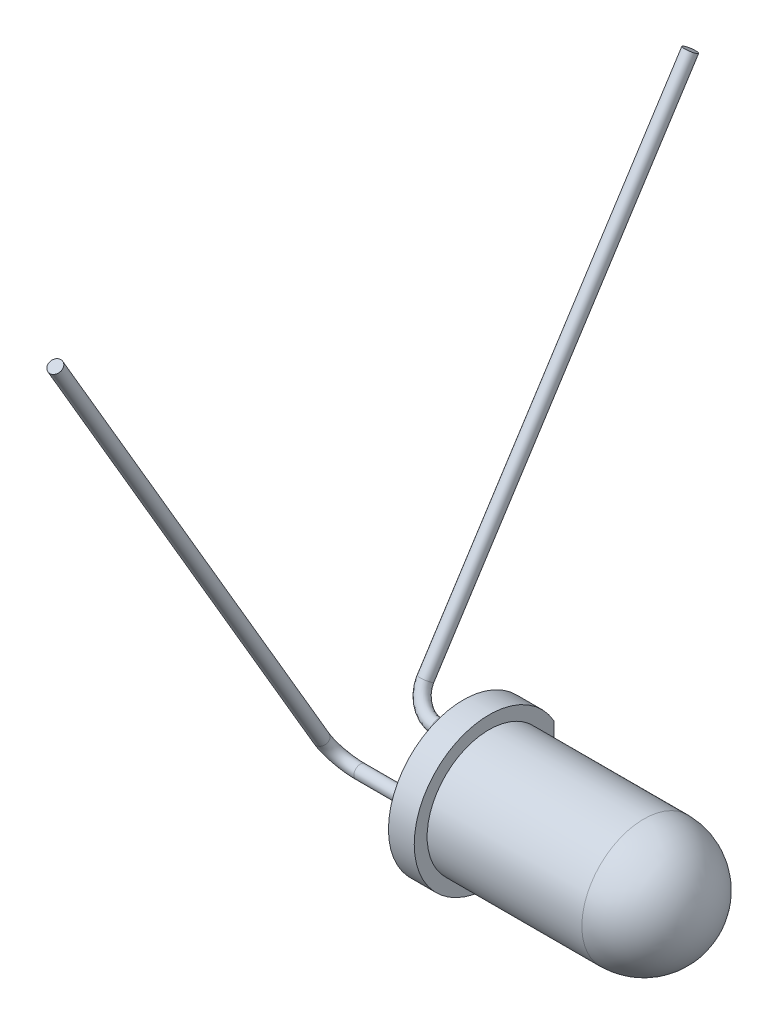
ISO-10303-21;
HEADER;
FILE_DESCRIPTION(('STEP AP214'),'2;1');
FILE_NAME('part.step','',(''),(''),'','','');
FILE_SCHEMA(('AUTOMOTIVE_DESIGN { 1 0 10303 214 1 1 1 1 }'));
ENDSEC;
DATA;
#1=APPLICATION_CONTEXT('core data for automotive mechanical design processes');
#2=APPLICATION_PROTOCOL_DEFINITION('international standard','automotive_design',2000,#1);
#3=PRODUCT_CONTEXT('',#1,'mechanical');
#4=PRODUCT('Part','Part','',(#3));
#5=PRODUCT_RELATED_PRODUCT_CATEGORY('part','',(#4));
#6=PRODUCT_DEFINITION_FORMATION('','',#4);
#7=PRODUCT_DEFINITION_CONTEXT('part definition',#1,'design');
#8=PRODUCT_DEFINITION('design','',#6,#7);
#9=PRODUCT_DEFINITION_SHAPE('','',#8);
#10=(LENGTH_UNIT() NAMED_UNIT(*) SI_UNIT(.MILLI.,.METRE.));
#11=(NAMED_UNIT(*) PLANE_ANGLE_UNIT() SI_UNIT($,.RADIAN.));
#12=(NAMED_UNIT(*) SI_UNIT($,.STERADIAN.) SOLID_ANGLE_UNIT());
#13=UNCERTAINTY_MEASURE_WITH_UNIT(LENGTH_MEASURE(1.E-05),#10,'distance_accuracy_value','');
#14=(GEOMETRIC_REPRESENTATION_CONTEXT(3) GLOBAL_UNCERTAINTY_ASSIGNED_CONTEXT((#13)) GLOBAL_UNIT_ASSIGNED_CONTEXT((#10,
#11,#12)) REPRESENTATION_CONTEXT('',''));
#15=CARTESIAN_POINT('',(0.,0.,0.));
#16=DIRECTION('',(0.,0.,1.));
#17=DIRECTION('',(1.,0.,0.));
#18=AXIS2_PLACEMENT_3D('',#15,#16,#17);
#19=CARTESIAN_POINT('',(-1.,0.,0.));
#20=DIRECTION('',(1.,0.,0.));
#21=DIRECTION('',(0.,0.,-1.));
#22=AXIS2_PLACEMENT_3D('',#19,#20,#21);
#23=PLANE('',#22);
#24=CARTESIAN_POINT('',(-1.,0.,0.));
#25=DIRECTION('',(-1.,0.,0.));
#26=DIRECTION('',(0.,0.,-1.));
#27=AXIS2_PLACEMENT_3D('',#24,#25,#26);
#28=CIRCLE('',#27,2.9);
#29=CARTESIAN_POINT('',(-1.,-1.44963185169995,-2.51168618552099));
#30=VERTEX_POINT('',#29);
#31=CARTESIAN_POINT('',(-1.,1.44963185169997,-2.51168618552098));
#32=VERTEX_POINT('',#31);
#33=EDGE_CURVE('E66',#30,#32,#28,.T.);
#34=ORIENTED_EDGE('',*,*,#33,.T.);
#35=DIRECTION('',(0.,-1.,0.));
#36=VECTOR('',#35,1.);
#37=CARTESIAN_POINT('',(-1.,1.44963185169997,-2.51168618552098));
#38=LINE('',#37,#36);
#39=EDGE_CURVE('E48',#32,#30,#38,.T.);
#40=ORIENTED_EDGE('',*,*,#39,.T.);
#41=EDGE_LOOP('',(#34,#40));
#42=FACE_BOUND('',#41,.T.);
#43=CARTESIAN_POINT('',(-1.,0.,-1.75));
#44=CARTESIAN_POINT('',(-1.,0.0140546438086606,-1.75000031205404));
#45=CARTESIAN_POINT('',(-1.,0.0281019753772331,-1.74881023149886));
#46=CARTESIAN_POINT('',(-1.,0.0558073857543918,-1.7440987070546));
#47=CARTESIAN_POINT('',(-1.,0.0694649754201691,-1.74057445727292));
#48=CARTESIAN_POINT('',(-1.,0.109213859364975,-1.72661145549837));
#49=CARTESIAN_POINT('',(-1.,0.134203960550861,-1.71278158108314));
#50=CARTESIAN_POINT('',(-1.,0.178142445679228,-1.67765371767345));
#51=CARTESIAN_POINT('',(-1.,0.197090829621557,-1.6563557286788));
#52=CARTESIAN_POINT('',(-1.,0.226884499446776,-1.60868185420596));
#53=CARTESIAN_POINT('',(-1.,0.237729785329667,-1.58230596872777));
#54=CARTESIAN_POINT('',(-1.,0.250074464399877,-1.52745292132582));
#55=CARTESIAN_POINT('',(-1.,0.251573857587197,-1.49897575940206));
#56=CARTESIAN_POINT('',(-1.,0.245063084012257,-1.44312995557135));
#57=CARTESIAN_POINT('',(-1.,0.237052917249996,-1.41576131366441));
#58=CARTESIAN_POINT('',(-1.,0.212424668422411,-1.36521836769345));
#59=CARTESIAN_POINT('',(-1.,0.195806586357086,-1.34204406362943));
#60=CARTESIAN_POINT('',(-1.,0.155836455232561,-1.30250246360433));
#61=CARTESIAN_POINT('',(-1.,0.13248440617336,-1.28613516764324));
#62=CARTESIAN_POINT('',(-1.,0.0816790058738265,-1.26205288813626));
#63=CARTESIAN_POINT('',(-1.,0.0542256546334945,-1.25433790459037));
#64=CARTESIAN_POINT('',(-1.,-0.00168717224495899,-1.248430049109));
#65=CARTESIAN_POINT('',(-1.,-0.0301466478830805,-1.25023717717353));
#66=CARTESIAN_POINT('',(-1.,-0.084863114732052,-1.2631698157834));
#67=CARTESIAN_POINT('',(-1.,-0.111120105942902,-1.27429532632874));
#68=CARTESIAN_POINT('',(-1.,-0.158471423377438,-1.30461037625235));
#69=CARTESIAN_POINT('',(-1.,-0.179565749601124,-1.32379991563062));
#70=CARTESIAN_POINT('',(-1.,-0.214213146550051,-1.36807968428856));
#71=CARTESIAN_POINT('',(-1.,-0.227766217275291,-1.39316991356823));
#72=CARTESIAN_POINT('',(-1.,-0.245804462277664,-1.44642182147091));
#73=CARTESIAN_POINT('',(-1.,-0.250289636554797,-1.47458350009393));
#74=CARTESIAN_POINT('',(-1.,-0.249681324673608,-1.53080518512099));
#75=CARTESIAN_POINT('',(-1.,-0.244587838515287,-1.55886519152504));
#76=CARTESIAN_POINT('',(-1.,-0.225415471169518,-1.61171291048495));
#77=CARTESIAN_POINT('',(-1.,-0.21133658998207,-1.6365006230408));
#78=CARTESIAN_POINT('',(-1.,-0.17570976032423,-1.68003550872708));
#79=CARTESIAN_POINT('',(-1.,-0.154161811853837,-1.69878268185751));
#80=CARTESIAN_POINT('',(-1.,-0.118208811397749,-1.72074448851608));
#81=CARTESIAN_POINT('',(-1.,-0.105589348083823,-1.72704522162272));
#82=CARTESIAN_POINT('',(-1.,-0.0794804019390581,-1.73744287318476));
#83=CARTESIAN_POINT('',(-1.,-0.065991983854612,-1.74154243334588));
#84=CARTESIAN_POINT('',(-1.,-0.0350937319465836,-1.74814497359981));
#85=CARTESIAN_POINT('',(-1.,-0.0175411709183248,-1.7499996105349));
#86=CARTESIAN_POINT('',(-1.,0.,-1.75));
#87=B_SPLINE_CURVE_WITH_KNOTS('',3,(#43,#44,#45,#46,#47,#48,#49,#50,#51,#52,#53,#54,#55,#56,#57,
#58,#59,#60,#61,#62,#63,#64,#65,#66,#67,#68,#69,#70,#71,#72,#73,#74,#75,#76,#77,#78,#79,#80,#81,
#82,#83,#84,#85,#86),.UNSPECIFIED.,.T.,.F.,(4,2,2,2,2,2,2,2,2,2,2,2,2,2,2,2,2,2,2,2,2,4),(0.,
0.0420958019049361,0.0842422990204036,0.168185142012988,0.25212798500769,0.336070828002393,
0.420013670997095,0.503956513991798,0.5878993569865,0.671842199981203,0.755785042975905,
0.839727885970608,0.92367072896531,1.00761357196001,1.09155641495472,1.17549925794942,
1.25944210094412,1.34338494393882,1.42732778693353,1.46947428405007,1.51157008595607,
1.56410856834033),.UNSPECIFIED.);
#88=CARTESIAN_POINT('',(-1.,0.,-1.75));
#89=VERTEX_POINT('',#88);
#90=EDGE_CURVE('E32',#89,#89,#87,.F.);
#91=ORIENTED_EDGE('',*,*,#90,.F.);
#92=EDGE_LOOP('',(#91));
#93=FACE_BOUND('',#92,.T.);
#94=CARTESIAN_POINT('',(-1.,0.,1.5));
#95=DIRECTION('',(-1.,0.,0.));
#96=DIRECTION('',(0.,0.,1.));
#97=AXIS2_PLACEMENT_3D('',#94,#95,#96);
#98=CIRCLE('',#97,0.25);
#99=CARTESIAN_POINT('',(-1.,0.,1.75));
#100=VERTEX_POINT('',#99);
#101=EDGE_CURVE('E11',#100,#100,#98,.T.);
#102=ORIENTED_EDGE('',*,*,#101,.F.);
#103=EDGE_LOOP('',(#102));
#104=FACE_BOUND('',#103,.T.);
#105=ADVANCED_FACE('F28',(#42,#93,#104),#23,.F.);
#106=CARTESIAN_POINT('',(6.,0.,0.));
#107=DIRECTION('',(-1.,0.,0.));
#108=DIRECTION('',(0.,0.,1.));
#109=AXIS2_PLACEMENT_3D('',#106,#107,#108);
#110=CYLINDRICAL_SURFACE('',#109,2.4);
#111=CARTESIAN_POINT('',(6.,0.,0.));
#112=DIRECTION('',(1.,0.,0.));
#113=DIRECTION('',(0.,0.,-1.));
#114=AXIS2_PLACEMENT_3D('',#111,#112,#113);
#115=CIRCLE('',#114,2.4);
#116=CARTESIAN_POINT('',(6.,0.,-2.4));
#117=VERTEX_POINT('',#116);
#118=EDGE_CURVE('E41',#117,#117,#115,.T.);
#119=ORIENTED_EDGE('',*,*,#118,.F.);
#120=EDGE_LOOP('',(#119));
#121=FACE_BOUND('',#120,.T.);
#122=CARTESIAN_POINT('',(0.,0.,0.));
#123=DIRECTION('',(1.,0.,0.));
#124=DIRECTION('',(0.,0.,-1.));
#125=AXIS2_PLACEMENT_3D('',#122,#123,#124);
#126=CIRCLE('',#125,2.4);
#127=CARTESIAN_POINT('',(0.,0.,-2.4));
#128=VERTEX_POINT('',#127);
#129=EDGE_CURVE('E73',#128,#128,#126,.T.);
#130=ORIENTED_EDGE('',*,*,#129,.T.);
#131=EDGE_LOOP('',(#130));
#132=FACE_BOUND('',#131,.T.);
#133=ADVANCED_FACE('F92',(#121,#132),#110,.T.);
#134=CARTESIAN_POINT('',(6.,0.,0.));
#135=DIRECTION('',(0.,0.,1.));
#136=DIRECTION('',(1.,0.,0.));
#137=AXIS2_PLACEMENT_3D('',#134,#135,#136);
#138=SPHERICAL_SURFACE('',#137,2.4);
#139=CARTESIAN_POINT('',(6.,0.,0.));
#140=DIRECTION('',(1.,0.,0.));
#141=DIRECTION('',(0.,0.,-1.));
#142=AXIS2_PLACEMENT_3D('',#139,#140,#141);
#143=SPHERICAL_SURFACE('',#142,2.4);
#144=ORIENTED_EDGE('',*,*,#118,.T.);
#145=EDGE_LOOP('',(#144));
#146=FACE_BOUND('',#145,.T.);
#147=ADVANCED_FACE('F30',(#146),#143,.T.);
#148=CARTESIAN_POINT('',(0.,0.,0.));
#149=DIRECTION('',(1.,0.,0.));
#150=DIRECTION('',(0.,0.,-1.));
#151=AXIS2_PLACEMENT_3D('',#148,#149,#150);
#152=PLANE('',#151);
#153=CARTESIAN_POINT('',(0.,0.,0.));
#154=DIRECTION('',(-1.,0.,0.));
#155=DIRECTION('',(0.,0.,-1.));
#156=AXIS2_PLACEMENT_3D('',#153,#154,#155);
#157=CIRCLE('',#156,2.9);
#158=CARTESIAN_POINT('',(0.,-1.44963185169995,-2.51168618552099));
#159=VERTEX_POINT('',#158);
#160=CARTESIAN_POINT('',(0.,1.44963185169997,-2.51168618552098));
#161=VERTEX_POINT('',#160);
#162=EDGE_CURVE('E64',#159,#161,#157,.T.);
#163=ORIENTED_EDGE('',*,*,#162,.F.);
#164=DIRECTION('',(0.,-1.,0.));
#165=VECTOR('',#164,1.);
#166=CARTESIAN_POINT('',(0.,1.44963185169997,-2.51168618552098));
#167=LINE('',#166,#165);
#168=EDGE_CURVE('E60',#161,#159,#167,.T.);
#169=ORIENTED_EDGE('',*,*,#168,.F.);
#170=EDGE_LOOP('',(#163,#169));
#171=FACE_BOUND('',#170,.T.);
#172=ORIENTED_EDGE('',*,*,#129,.F.);
#173=EDGE_LOOP('',(#172));
#174=FACE_BOUND('',#173,.T.);
#175=ADVANCED_FACE('F61',(#171,#174),#152,.T.);
#176=CARTESIAN_POINT('',(-1.,0.,0.));
#177=DIRECTION('',(1.,0.,0.));
#178=DIRECTION('',(0.,0.,-1.));
#179=AXIS2_PLACEMENT_3D('',#176,#177,#178);
#180=CYLINDRICAL_SURFACE('',#179,2.9);
#181=ORIENTED_EDGE('',*,*,#162,.T.);
#182=DIRECTION('',(1.,0.,0.));
#183=VECTOR('',#182,1.);
#184=CARTESIAN_POINT('',(-1.,1.44963185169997,-2.51168618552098));
#185=LINE('',#184,#183);
#186=EDGE_CURVE('E69',#32,#161,#185,.T.);
#187=ORIENTED_EDGE('',*,*,#186,.F.);
#188=ORIENTED_EDGE('',*,*,#33,.F.);
#189=DIRECTION('',(1.,0.,0.));
#190=VECTOR('',#189,1.);
#191=CARTESIAN_POINT('',(-1.,-1.44963185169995,-2.51168618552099));
#192=LINE('',#191,#190);
#193=EDGE_CURVE('E74',#30,#159,#192,.T.);
#194=ORIENTED_EDGE('',*,*,#193,.T.);
#195=EDGE_LOOP('',(#181,#187,#188,#194));
#196=FACE_BOUND('',#195,.T.);
#197=ADVANCED_FACE('F76',(#196),#180,.T.);
#198=CARTESIAN_POINT('',(-1.,1.44963185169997,-2.51168618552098));
#199=DIRECTION('',(0.,0.,1.));
#200=DIRECTION('',(0.,-1.,0.));
#201=AXIS2_PLACEMENT_3D('',#198,#199,#200);
#202=PLANE('',#201);
#203=ORIENTED_EDGE('',*,*,#168,.T.);
#204=ORIENTED_EDGE('',*,*,#193,.F.);
#205=ORIENTED_EDGE('',*,*,#39,.F.);
#206=ORIENTED_EDGE('',*,*,#186,.T.);
#207=EDGE_LOOP('',(#203,#204,#205,#206));
#208=FACE_BOUND('',#207,.T.);
#209=ADVANCED_FACE('F70',(#208),#202,.F.);
#210=CARTESIAN_POINT('',(-4.5,0.841594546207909,-2.03943699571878));
#211=DIRECTION('',(0.000145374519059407,0.841349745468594,-0.540491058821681));
#212=DIRECTION('',(-0.540109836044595,0.454940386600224,0.708032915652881));
#213=AXIS2_PLACEMENT_3D('',#210,#211,#212);
#214=CIRCLE('',#213,0.25);
#215=DIRECTION('',(0.,0.84147216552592,-0.54030046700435));
#216=VECTOR('',#215,1.);
#217=SURFACE_OF_LINEAR_EXTRUSION('',#214,#216);
#218=CARTESIAN_POINT('',(-4.63502745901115,0.955329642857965,-1.86242876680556));
#219=VERTEX_POINT('',#218);
#220=EDGE_CURVE('E80',#219,#219,#214,.T.);
#221=ORIENTED_EDGE('',*,*,#220,.T.);
#222=EDGE_LOOP('',(#221));
#223=FACE_BOUND('',#222,.T.);
#224=CARTESIAN_POINT('',(-4.5,16.8265060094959,-12.3031812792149));
#225=DIRECTION('',(0.000145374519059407,0.841349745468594,-0.540491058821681));
#226=DIRECTION('',(-0.540109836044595,0.454940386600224,0.708032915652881));
#227=AXIS2_PLACEMENT_3D('',#224,#225,#226);
#228=CIRCLE('',#227,0.25);
#229=CARTESIAN_POINT('',(-4.63502745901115,16.940241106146,-12.1261730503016));
#230=VERTEX_POINT('',#229);
#231=EDGE_CURVE('E77',#230,#230,#228,.T.);
#232=ORIENTED_EDGE('',*,*,#231,.F.);
#233=EDGE_LOOP('',(#232));
#234=FACE_BOUND('',#233,.T.);
#235=ADVANCED_FACE('F113',(#223,#234),#217,.T.);
#236=CARTESIAN_POINT('',(-3.49985459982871,0.,-1.49932714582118));
#237=DIRECTION('',(-1.,0.,0.));
#238=DIRECTION('',(0.,0.,1.));
#239=AXIS2_PLACEMENT_3D('',#236,#237,#238);
#240=CIRCLE('',#239,0.25);
#241=CARTESIAN_POINT('',(-3.5000000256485,0.841472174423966,-2.03962757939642));
#242=DIRECTION('',(-0.000226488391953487,-0.540300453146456,-0.841472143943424));
#243=AXIS1_PLACEMENT('',#241,#242);
#244=SURFACE_OF_REVOLUTION('',#240,#243);
#245=CARTESIAN_POINT('',(-3.49985459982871,0.,-1.24932714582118));
#246=VERTEX_POINT('',#245);
#247=EDGE_CURVE('E129',#246,#246,#240,.T.);
#248=ORIENTED_EDGE('',*,*,#247,.T.);
#249=EDGE_LOOP('',(#248));
#250=FACE_BOUND('',#249,.T.);
#251=ORIENTED_EDGE('',*,*,#220,.F.);
#252=EDGE_LOOP('',(#251));
#253=FACE_BOUND('',#252,.T.);
#254=ADVANCED_FACE('F117',(#250,#253),#244,.F.);
#255=DIRECTION('',(0.999999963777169,0.,-0.000269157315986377));
#256=VECTOR('',#255,1.);
#257=SURFACE_OF_LINEAR_EXTRUSION('',#240,#256);
#258=ORIENTED_EDGE('',*,*,#247,.F.);
#259=EDGE_LOOP('',(#258));
#260=FACE_BOUND('',#259,.T.);
#261=ORIENTED_EDGE('',*,*,#90,.T.);
#262=EDGE_LOOP('',(#261));
#263=FACE_BOUND('',#262,.T.);
#264=ADVANCED_FACE('F122',(#260,#263),#257,.F.);
#265=CARTESIAN_POINT('',(-4.5,16.8265060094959,-12.3031812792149));
#266=DIRECTION('',(0.000145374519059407,0.841349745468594,-0.540491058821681));
#267=DIRECTION('',(-0.540109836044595,0.454940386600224,0.708032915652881));
#268=AXIS2_PLACEMENT_3D('',#265,#266,#267);
#269=PLANE('',#268);
#270=ORIENTED_EDGE('',*,*,#231,.T.);
#271=EDGE_LOOP('',(#270));
#272=FACE_BOUND('',#271,.T.);
#273=ADVANCED_FACE('F139',(#272),#269,.T.);
#274=CARTESIAN_POINT('',(-4.48906330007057,0.862832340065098,2.00447128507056));
#275=DIRECTION('',(-0.000514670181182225,0.863276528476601,0.504730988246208));
#276=DIRECTION('',(0.,-0.504731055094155,0.863276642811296));
#277=AXIS2_PLACEMENT_3D('',#274,#275,#276);
#278=CYLINDRICAL_SURFACE('',#277,0.25);
#279=CARTESIAN_POINT('',(-4.48906330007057,0.862832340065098,2.00447128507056));
#280=DIRECTION('',(-0.000514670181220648,0.863276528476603,0.504730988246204));
#281=DIRECTION('',(0.504730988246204,-0.435498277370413,0.745377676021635));
#282=AXIS2_PLACEMENT_3D('',#279,#280,#281);
#283=CIRCLE('',#282,0.25);
#284=CARTESIAN_POINT('',(-4.73906326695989,0.862721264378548,2.00440634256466));
#285=VERTEX_POINT('',#284);
#286=EDGE_CURVE('E162',#285,#285,#283,.T.);
#287=ORIENTED_EDGE('',*,*,#286,.T.);
#288=EDGE_LOOP('',(#287));
#289=FACE_BOUND('',#288,.T.);
#290=CARTESIAN_POINT('',(-4.49958019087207,18.5032267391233,12.3182622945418));
#291=DIRECTION('',(-0.000514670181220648,0.863276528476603,0.504730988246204));
#292=DIRECTION('',(0.504730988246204,-0.435498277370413,0.745377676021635));
#293=AXIS2_PLACEMENT_3D('',#290,#291,#292);
#294=CIRCLE('',#293,0.25);
#295=CARTESIAN_POINT('',(-4.37339744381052,18.3943521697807,12.5046067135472));
#296=VERTEX_POINT('',#295);
#297=EDGE_CURVE('E133',#296,#296,#294,.T.);
#298=ORIENTED_EDGE('',*,*,#297,.F.);
#299=EDGE_LOOP('',(#298));
#300=FACE_BOUND('',#299,.T.);
#301=ADVANCED_FACE('F142',(#289,#300),#278,.T.);
#302=CARTESIAN_POINT('',(-3.48906343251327,0.863276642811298,2.00473105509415));
#303=DIRECTION('',(0.,0.504731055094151,-0.863276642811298));
#304=DIRECTION('',(0.,0.863276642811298,0.504731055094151));
#305=AXIS2_PLACEMENT_3D('',#302,#303,#304);
#306=TOROIDAL_SURFACE('',#305,1.,0.25);
#307=CARTESIAN_POINT('',(-3.48906343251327,0.,1.5));
#308=DIRECTION('',(-1.,0.,0.));
#309=DIRECTION('',(0.,0.,1.));
#310=AXIS2_PLACEMENT_3D('',#307,#308,#309);
#311=CIRCLE('',#310,0.25);
#312=CARTESIAN_POINT('',(-3.48906343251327,-0.215819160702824,1.37381723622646));
#313=VERTEX_POINT('',#312);
#314=EDGE_CURVE('E165',#313,#313,#311,.T.);
#315=CARTESIAN_POINT('',(-3.48906343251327,0.863276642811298,2.00473105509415));
#316=DIRECTION('',(0.,0.504731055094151,-0.863276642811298));
#317=DIRECTION('',(0.,0.863276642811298,0.504731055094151));
#318=AXIS2_PLACEMENT_3D('',#315,#316,#317);
#319=CIRCLE('',#318,1.25);
#320=EDGE_CURVE('',#313,#285,#319,.T.);
#321=ORIENTED_EDGE('',*,*,#314,.T.);
#322=ORIENTED_EDGE('',*,*,#286,.F.);
#323=ORIENTED_EDGE('',*,*,#320,.T.);
#324=ORIENTED_EDGE('',*,*,#320,.F.);
#325=EDGE_LOOP('',(#321,#323,#322,#324));
#326=FACE_BOUND('',#325,.T.);
#327=ADVANCED_FACE('F145',(#326),#306,.T.);
#328=CARTESIAN_POINT('',(-3.48906343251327,0.,1.5));
#329=DIRECTION('',(1.,0.,0.));
#330=DIRECTION('',(0.,1.,0.));
#331=AXIS2_PLACEMENT_3D('',#328,#329,#330);
#332=CYLINDRICAL_SURFACE('',#331,0.25);
#333=ORIENTED_EDGE('',*,*,#314,.F.);
#334=EDGE_LOOP('',(#333));
#335=FACE_BOUND('',#334,.T.);
#336=ORIENTED_EDGE('',*,*,#101,.T.);
#337=EDGE_LOOP('',(#336));
#338=FACE_BOUND('',#337,.T.);
#339=ADVANCED_FACE('F149',(#335,#338),#332,.T.);
#340=CARTESIAN_POINT('',(-4.49958019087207,18.5032267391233,12.3182622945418));
#341=DIRECTION('',(-0.000514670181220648,0.863276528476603,0.504730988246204));
#342=DIRECTION('',(0.504730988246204,-0.435498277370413,0.745377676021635));
#343=AXIS2_PLACEMENT_3D('',#340,#341,#342);
#344=PLANE('',#343);
#345=ORIENTED_EDGE('',*,*,#297,.T.);
#346=EDGE_LOOP('',(#345));
#347=FACE_BOUND('',#346,.T.);
#348=ADVANCED_FACE('F153',(#347),#344,.T.);
#349=CLOSED_SHELL('',(#105,#133,#147,#175,#197,#209,#235,#254,#264,#273,#301,#327,#339,#348));
#350=MANIFOLD_SOLID_BREP('B2',#349);
#351=ADVANCED_BREP_SHAPE_REPRESENTATION('',(#18,#350),#14);
#352=SHAPE_DEFINITION_REPRESENTATION(#9,#351);
ENDSEC;
END-ISO-10303-21;
